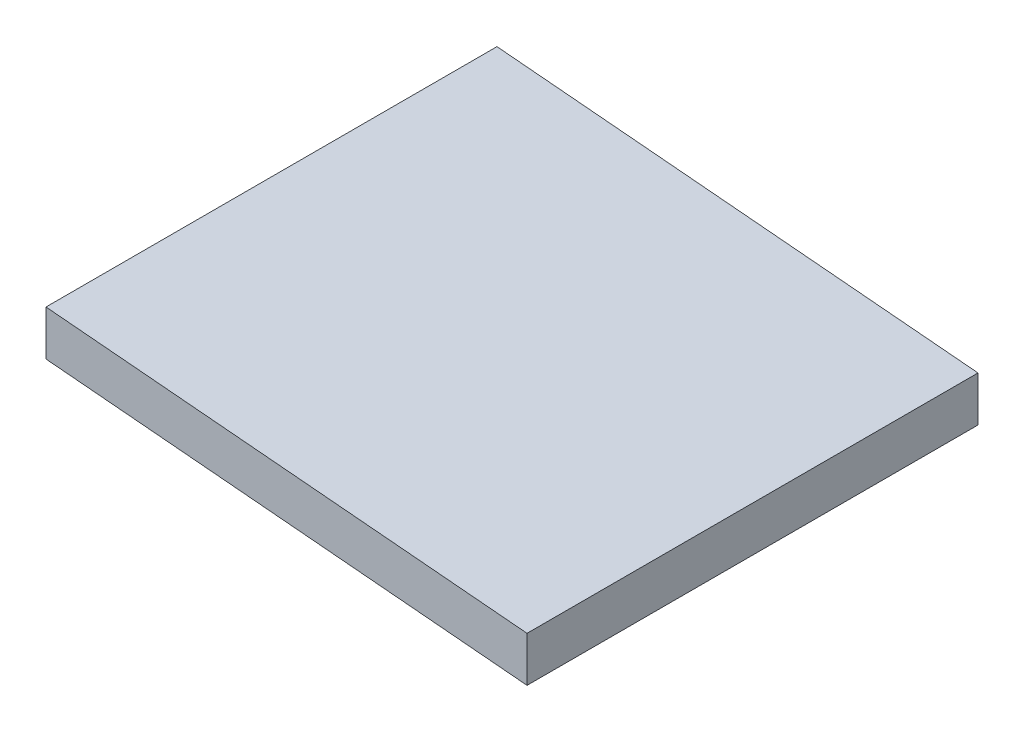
from build123d import *

# Parameters (mm, degrees)
AUFSATZ_LINEAR_AUSTRAGEN1_DEPTH = 30


with BuildPart() as part:
    # Skizze1 → Aufsatz-Linear austragen1 (new body)
    with BuildSketch(Plane.XY):
        Polygon((0, 0), (-32, 2.799637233), (-32, 5.799637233), (0, 3), align=None)
    extrude(amount=AUFSATZ_LINEAR_AUSTRAGEN1_DEPTH)


solid = part.part
